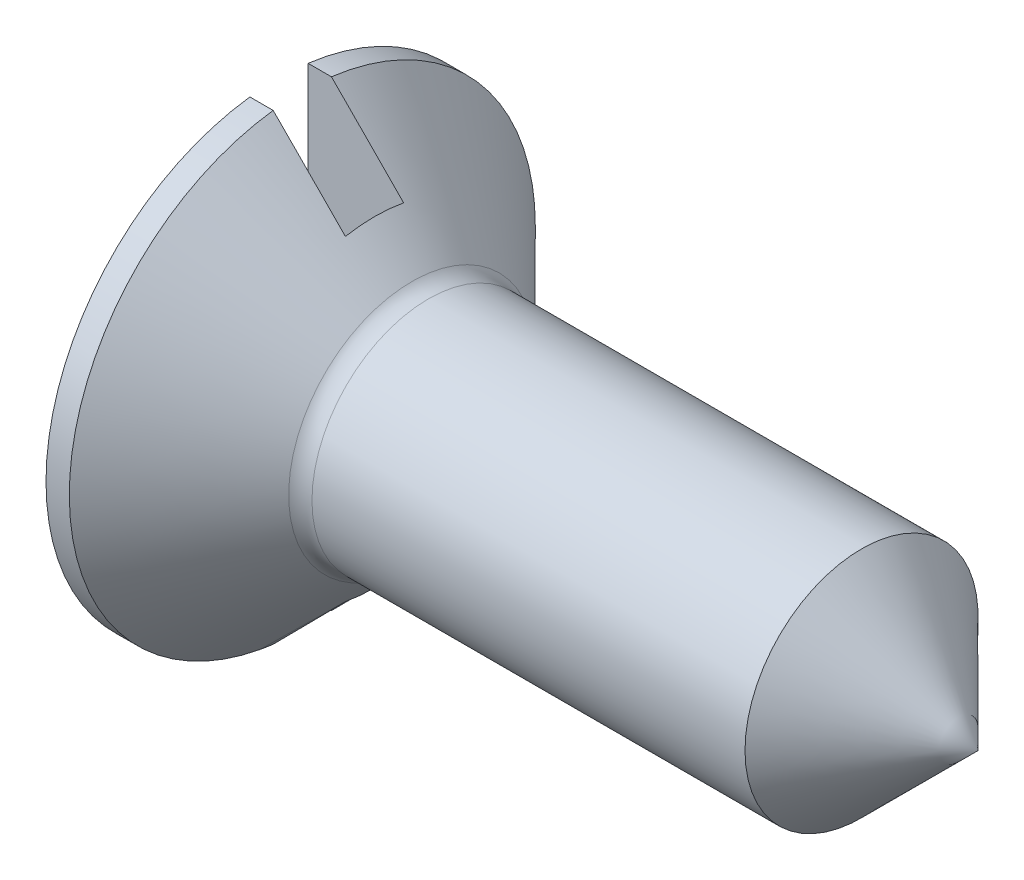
from build123d import *

# Parameters (mm, degrees)
SKETCH1_R          = 1
BASEBODY_DEPTH     = 4.8
SKETCH3_R          = 2.2
SKETCH3_R_2        = 2
CUT_EXTRUDE1_DEPTH = 8.445077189
SLOT_DEPTH         = 7.05673892
SLOT_DEPTH_BACK    = 7.05673892
SKETCH4_W          = 0.5
SKETCH4_H          = 0.82
FILLET1_R          = 0.2


with BuildPart() as part:
    # Sketch2 → BaseHead (revolve)
    with BuildSketch(Plane(origin=(1.60933929, 0, 0.59066071), x_dir=(0, 0, -1), z_dir=(0, 1, 0))):
        Polygon((1.59066071, 0.40933929), (2.79066071, 1.60933929), (0.59066071, 1.60933929), (0.59066071, 0.40933929), align=None)
    revolve(axis=Axis((6, 0, 0), (-1, 0, 0)))

    # Sketch1 → BaseBody (add)
    with BuildSketch(Plane(origin=(1.2, -0.034835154, 0.056110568), x_dir=(0, 0, -1), z_dir=(1, 0, 0))):
        with Locations((0.056110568, 0.034835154)):
            Circle(SKETCH1_R)
    extrude(amount=BASEBODY_DEPTH)

    # Sketch3 → Cut-Extrude1 (cut, through all)
    with BuildSketch(Plane(origin=(0, -1.05900049, 0.767842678), x_dir=(0, 0, 1), z_dir=(-1, 0, 0))):
        with Locations((-0.767842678, 1.05900049)):
            Circle(SKETCH3_R)
        with Locations((-0.767842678, 1.05900049)):
            Circle(SKETCH3_R_2, mode=Mode.SUBTRACT)
    extrude(amount=-CUT_EXTRUDE1_DEPTH, mode=Mode.SUBTRACT)

    # Sketch4 → Slot (cut, two sides: drawn at the far end of the back side and taken through both)
    with BuildSketch(Plane(origin=(1.415155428, 0, -1.415155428), x_dir=(0, 0, -1), z_dir=(0, 1, 0)).offset(-SLOT_DEPTH_BACK)):
        with Locations((-1.415155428, 1.005155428)):
            Rectangle(SKETCH4_W, SKETCH4_H)
    extrude(amount=SLOT_DEPTH + SLOT_DEPTH_BACK, mode=Mode.SUBTRACT)

    # Sketch5 → Cut-Revolve1 (revolve, cut)
    with BuildSketch(Plane(origin=(23.669440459, -6.330559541, 0), x_dir=(0, 1, 0), z_dir=(0, 0, 1)), mode=Mode.PRIVATE) as cut_revolve1_sk:
        Polygon((6.330559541, 17.323959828), (36.330559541, 17.323959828), (36.330559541, 47.669440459), (6.330559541, 17.669440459), align=None)
    revolve(cut_revolve1_sk.sketch.rotate(Axis((30.330559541, 0, 0), (-1, 0, 0)), 190.437302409), axis=Axis((30.330559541, 0, 0), (-1, 0, 0)), mode=Mode.SUBTRACT)

    # Fillet1
    fillet1_edges = [part.edges().sort_by_distance(p)[0] for p in [
        (1.2, 0, 1),
    ]]
    fillet(fillet1_edges, radius=FILLET1_R)


solid = part.part
